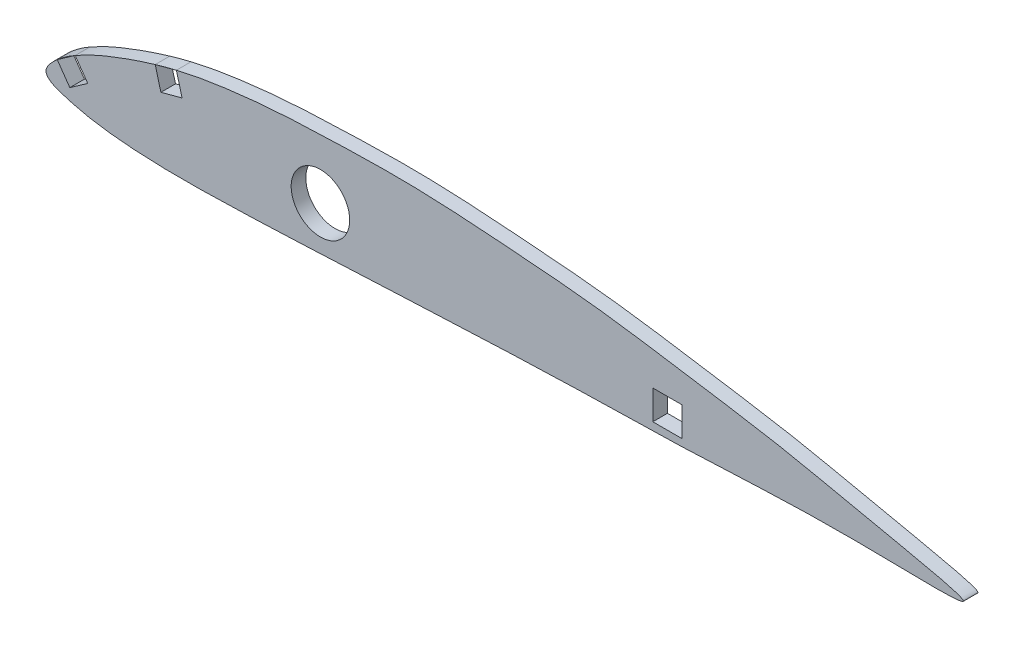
ISO-10303-21;
HEADER;
FILE_DESCRIPTION(('STEP AP214'),'2;1');
FILE_NAME('part.step','',(''),(''),'','','');
FILE_SCHEMA(('AUTOMOTIVE_DESIGN { 1 0 10303 214 1 1 1 1 }'));
ENDSEC;
DATA;
#1=APPLICATION_CONTEXT('core data for automotive mechanical design processes');
#2=APPLICATION_PROTOCOL_DEFINITION('international standard','automotive_design',2000,#1);
#3=PRODUCT_CONTEXT('',#1,'mechanical');
#4=PRODUCT('Part','Part','',(#3));
#5=PRODUCT_RELATED_PRODUCT_CATEGORY('part','',(#4));
#6=PRODUCT_DEFINITION_FORMATION('','',#4);
#7=PRODUCT_DEFINITION_CONTEXT('part definition',#1,'design');
#8=PRODUCT_DEFINITION('design','',#6,#7);
#9=PRODUCT_DEFINITION_SHAPE('','',#8);
#10=(LENGTH_UNIT() NAMED_UNIT(*) SI_UNIT(.MILLI.,.METRE.));
#11=(NAMED_UNIT(*) PLANE_ANGLE_UNIT() SI_UNIT($,.RADIAN.));
#12=(NAMED_UNIT(*) SI_UNIT($,.STERADIAN.) SOLID_ANGLE_UNIT());
#13=UNCERTAINTY_MEASURE_WITH_UNIT(LENGTH_MEASURE(1.E-05),#10,'distance_accuracy_value','');
#14=(GEOMETRIC_REPRESENTATION_CONTEXT(3) GLOBAL_UNCERTAINTY_ASSIGNED_CONTEXT((#13)) GLOBAL_UNIT_ASSIGNED_CONTEXT((#10,
#11,#12)) REPRESENTATION_CONTEXT('',''));
#15=CARTESIAN_POINT('',(0.,0.,0.));
#16=DIRECTION('',(0.,0.,1.));
#17=DIRECTION('',(1.,0.,0.));
#18=AXIS2_PLACEMENT_3D('',#15,#16,#17);
#19=CARTESIAN_POINT('',(0.,0.,0.));
#20=DIRECTION('',(0.,0.,-1.));
#21=DIRECTION('',(-1.,0.,0.));
#22=AXIS2_PLACEMENT_3D('',#19,#20,#21);
#23=PLANE('',#22);
#24=DIRECTION('',(0.,1.,0.));
#25=VECTOR('',#24,1.);
#26=CARTESIAN_POINT('',(131.732,0.,0.));
#27=LINE('',#26,#25);
#28=CARTESIAN_POINT('',(131.732,0.,0.));
#29=VERTEX_POINT('',#28);
#30=CARTESIAN_POINT('',(131.732,6.35,0.));
#31=VERTEX_POINT('',#30);
#32=EDGE_CURVE('E195',#29,#31,#27,.T.);
#33=ORIENTED_EDGE('',*,*,#32,.F.);
#34=DIRECTION('',(-1.,0.,0.));
#35=VECTOR('',#34,1.);
#36=CARTESIAN_POINT('',(0.,0.,0.));
#37=LINE('',#36,#35);
#38=CARTESIAN_POINT('',(138.082,0.,0.));
#39=VERTEX_POINT('',#38);
#40=EDGE_CURVE('E143',#39,#29,#37,.T.);
#41=ORIENTED_EDGE('',*,*,#40,.F.);
#42=DIRECTION('',(0.,-1.,0.));
#43=VECTOR('',#42,1.);
#44=CARTESIAN_POINT('',(138.082,0.,0.));
#45=LINE('',#44,#43);
#46=CARTESIAN_POINT('',(138.082,6.35,0.));
#47=VERTEX_POINT('',#46);
#48=EDGE_CURVE('E131',#47,#39,#45,.T.);
#49=ORIENTED_EDGE('',*,*,#48,.F.);
#50=DIRECTION('',(1.,0.,0.));
#51=VECTOR('',#50,1.);
#52=CARTESIAN_POINT('',(0.,6.35,0.));
#53=LINE('',#52,#51);
#54=EDGE_CURVE('E151',#31,#47,#53,.T.);
#55=ORIENTED_EDGE('',*,*,#54,.F.);
#56=EDGE_LOOP('',(#33,#41,#49,#55));
#57=FACE_BOUND('',#56,.T.);
#58=DIRECTION('',(-0.573576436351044,0.819152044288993,0.));
#59=VECTOR('',#58,1.);
#60=CARTESIAN_POINT('',(3.25221507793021,2.277225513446,0.));
#61=LINE('',#60,#59);
#62=CARTESIAN_POINT('',(5.16941881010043,-0.460825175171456,0.));
#63=VERTEX_POINT('',#62);
#64=CARTESIAN_POINT('',(2.43776103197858,3.44038643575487,0.));
#65=VERTEX_POINT('',#64);
#66=EDGE_CURVE('E157',#63,#65,#61,.T.);
#67=ORIENTED_EDGE('',*,*,#66,.F.);
#68=DIRECTION('',(-0.819152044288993,-0.573576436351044,0.));
#69=VECTOR('',#68,1.);
#70=CARTESIAN_POINT('',(1.91720373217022,-2.73805068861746,0.));
#71=LINE('',#70,#69);
#72=CARTESIAN_POINT('',(9.07063042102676,2.27083260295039,0.));
#73=VERTEX_POINT('',#72);
#74=EDGE_CURVE('E214',#73,#63,#71,.T.);
#75=ORIENTED_EDGE('',*,*,#74,.F.);
#76=DIRECTION('',(0.573576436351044,-0.819152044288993,0.));
#77=VECTOR('',#76,1.);
#78=CARTESIAN_POINT('',(7.15342668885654,5.00888329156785,0.));
#79=LINE('',#78,#77);
#80=CARTESIAN_POINT('',(6.33897264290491,6.17204421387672,0.));
#81=VERTEX_POINT('',#80);
#82=EDGE_CURVE('E224',#81,#73,#79,.T.);
#83=ORIENTED_EDGE('',*,*,#82,.F.);
#84=CARTESIAN_POINT('',(0.,0.,0.));
#85=CARTESIAN_POINT('',(-0.054866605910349,1.06548136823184,0.));
#86=CARTESIAN_POINT('',(2.27173112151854,3.45728737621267,0.));
#87=CARTESIAN_POINT('',(5.57621818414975,5.82398655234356,0.));
#88=CARTESIAN_POINT('',(9.8590794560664,8.13026814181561,0.));
#89=CARTESIAN_POINT('',(18.0609158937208,11.4665419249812,0.));
#90=CARTESIAN_POINT('',(28.0102288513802,14.6409150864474,0.));
#91=CARTESIAN_POINT('',(39.7874006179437,16.5242929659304,0.));
#92=CARTESIAN_POINT('',(49.7692370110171,17.5204467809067,0.));
#93=CARTESIAN_POINT('',(63.056038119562,18.0772974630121,0.));
#94=CARTESIAN_POINT('',(79.6812557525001,18.5488361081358,0.));
#95=CARTESIAN_POINT('',(99.5792865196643,17.1523075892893,0.));
#96=CARTESIAN_POINT('',(119.620979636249,15.590660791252,0.));
#97=CARTESIAN_POINT('',(139.20791019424,12.4529841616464,0.));
#98=CARTESIAN_POINT('',(160.219389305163,9.24084376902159,0.));
#99=CARTESIAN_POINT('',(176.254578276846,5.46848372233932,0.));
#100=CARTESIAN_POINT('',(210.388323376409,-1.29279230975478,0.));
#101=CARTESIAN_POINT('',(166.22275000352,0.262824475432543,0.));
#102=CARTESIAN_POINT('',(147.016186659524,-1.49488148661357,0.));
#103=CARTESIAN_POINT('',(105.554394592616,-2.14848036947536,0.));
#104=CARTESIAN_POINT('',(73.1438515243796,-3.91449443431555,0.));
#105=CARTESIAN_POINT('',(39.7743170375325,-5.3690409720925,0.));
#106=CARTESIAN_POINT('',(23.3749737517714,-5.63794403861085,0.));
#107=CARTESIAN_POINT('',(11.3042610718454,-4.46885896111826,0.));
#108=CARTESIAN_POINT('',(5.1592422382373,-3.06380477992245,0.));
#109=CARTESIAN_POINT('',(0.0752912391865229,-1.46211727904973,0.));
#110=CARTESIAN_POINT('',(0.,0.,0.));
#111=B_SPLINE_CURVE_WITH_KNOTS('',3,(#84,#85,#86,#87,#88,#89,#90,#91,#92,#93,#94,#95,#96,#97,
#98,#99,#100,#101,#102,#103,#104,#105,#106,#107,#108,#109,#110),.UNSPECIFIED.,.T.,.F.,(4,1,1,1,
1,1,1,1,1,1,1,1,1,1,1,1,1,1,1,1,1,1,1,1,4),(0.,0.0105604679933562,0.0182111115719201,
0.0322098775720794,0.0455249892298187,0.0840694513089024,0.10897429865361,0.133649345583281,
0.158232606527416,0.207343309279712,0.25652270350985,0.30582635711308,0.355445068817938,
0.40521420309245,0.4553904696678,0.506006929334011,0.555121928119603,0.653369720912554,
0.702490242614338,0.849938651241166,0.899083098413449,0.948194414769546,0.972905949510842,
0.985508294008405,1.),.UNSPECIFIED.);
#112=CARTESIAN_POINT('',(23.7053663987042,13.1425471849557,0.));
#113=VERTEX_POINT('',#112);
#114=EDGE_CURVE('E170',#81,#113,#111,.T.);
#115=ORIENTED_EDGE('',*,*,#114,.T.);
#116=DIRECTION('',(-0.258819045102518,0.965925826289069,0.));
#117=VECTOR('',#116,1.);
#118=CARTESIAN_POINT('',(25.4030447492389,6.80672532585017,0.));
#119=LINE('',#118,#117);
#120=CARTESIAN_POINT('',(24.9379921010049,8.54232543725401,0.));
#121=VERTEX_POINT('',#120);
#122=EDGE_CURVE('E206',#121,#113,#119,.T.);
#123=ORIENTED_EDGE('',*,*,#122,.F.);
#124=DIRECTION('',(-0.965925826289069,-0.258819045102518,0.));
#125=VECTOR('',#124,1.);
#126=CARTESIAN_POINT('',(-0.465052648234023,1.73560011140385,0.));
#127=LINE('',#126,#125);
#128=CARTESIAN_POINT('',(29.5382138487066,9.77495113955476,0.));
#129=VERTEX_POINT('',#128);
#130=EDGE_CURVE('E218',#129,#121,#127,.T.);
#131=ORIENTED_EDGE('',*,*,#130,.F.);
#132=DIRECTION('',(0.258819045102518,-0.965925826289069,0.));
#133=VECTOR('',#132,1.);
#134=CARTESIAN_POINT('',(30.0032664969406,8.03935102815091,0.));
#135=LINE('',#134,#133);
#136=CARTESIAN_POINT('',(28.3055881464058,14.3751728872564,0.));
#137=VERTEX_POINT('',#136);
#138=EDGE_CURVE('E228',#137,#129,#135,.T.);
#139=ORIENTED_EDGE('',*,*,#138,.F.);
#140=EDGE_CURVE('E163',#137,#65,#111,.T.);
#141=ORIENTED_EDGE('',*,*,#140,.T.);
#142=EDGE_LOOP('',(#67,#75,#83,#115,#123,#131,#139,#141));
#143=FACE_BOUND('',#142,.T.);
#144=CARTESIAN_POINT('',(59.575,5.,0.));
#145=DIRECTION('',(0.,0.,-1.));
#146=DIRECTION('',(-1.,0.,0.));
#147=AXIS2_PLACEMENT_3D('',#144,#145,#146);
#148=CIRCLE('',#147,6.35);
#149=CARTESIAN_POINT('',(53.225,5.,0.));
#150=VERTEX_POINT('',#149);
#151=EDGE_CURVE('E201',#150,#150,#148,.T.);
#152=ORIENTED_EDGE('',*,*,#151,.F.);
#153=EDGE_LOOP('',(#152));
#154=FACE_BOUND('',#153,.T.);
#155=ADVANCED_FACE('F44',(#57,#143,#154),#23,.T.);
#156=CARTESIAN_POINT('',(0.,0.,3.175));
#157=DIRECTION('',(0.,0.,-1.));
#158=DIRECTION('',(-1.,0.,0.));
#159=AXIS2_PLACEMENT_3D('',#156,#157,#158);
#160=PLANE('',#159);
#161=DIRECTION('',(1.,0.,0.));
#162=VECTOR('',#161,1.);
#163=CARTESIAN_POINT('',(131.732,0.,3.175));
#164=LINE('',#163,#162);
#165=CARTESIAN_POINT('',(131.732,0.,3.175));
#166=VERTEX_POINT('',#165);
#167=CARTESIAN_POINT('',(138.082,0.,3.175));
#168=VERTEX_POINT('',#167);
#169=EDGE_CURVE('E13',#166,#168,#164,.T.);
#170=ORIENTED_EDGE('',*,*,#169,.F.);
#171=DIRECTION('',(0.,-1.,0.));
#172=VECTOR('',#171,1.);
#173=CARTESIAN_POINT('',(131.732,6.35,3.175));
#174=LINE('',#173,#172);
#175=CARTESIAN_POINT('',(131.732,6.35,3.175));
#176=VERTEX_POINT('',#175);
#177=EDGE_CURVE('E149',#176,#166,#174,.T.);
#178=ORIENTED_EDGE('',*,*,#177,.F.);
#179=DIRECTION('',(-1.,0.,0.));
#180=VECTOR('',#179,1.);
#181=CARTESIAN_POINT('',(131.732,6.35,3.175));
#182=LINE('',#181,#180);
#183=CARTESIAN_POINT('',(138.082,6.35,3.175));
#184=VERTEX_POINT('',#183);
#185=EDGE_CURVE('E142',#184,#176,#182,.T.);
#186=ORIENTED_EDGE('',*,*,#185,.F.);
#187=DIRECTION('',(0.,1.,0.));
#188=VECTOR('',#187,1.);
#189=CARTESIAN_POINT('',(138.082,6.35,3.175));
#190=LINE('',#189,#188);
#191=EDGE_CURVE('E128',#168,#184,#190,.T.);
#192=ORIENTED_EDGE('',*,*,#191,.F.);
#193=EDGE_LOOP('',(#170,#178,#186,#192));
#194=FACE_BOUND('',#193,.T.);
#195=CARTESIAN_POINT('',(59.575,5.,3.175));
#196=DIRECTION('',(0.,0.,1.));
#197=DIRECTION('',(1.,0.,0.));
#198=AXIS2_PLACEMENT_3D('',#195,#196,#197);
#199=CIRCLE('',#198,6.35);
#200=CARTESIAN_POINT('',(65.925,5.,3.175));
#201=VERTEX_POINT('',#200);
#202=EDGE_CURVE('E203',#201,#201,#199,.T.);
#203=ORIENTED_EDGE('',*,*,#202,.F.);
#204=EDGE_LOOP('',(#203));
#205=FACE_BOUND('',#204,.T.);
#206=DIRECTION('',(0.819152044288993,0.573576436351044,0.));
#207=VECTOR('',#206,1.);
#208=CARTESIAN_POINT('',(5.16941881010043,-0.460825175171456,3.175));
#209=LINE('',#208,#207);
#210=CARTESIAN_POINT('',(5.16941881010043,-0.460825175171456,3.175));
#211=VERTEX_POINT('',#210);
#212=CARTESIAN_POINT('',(9.07063042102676,2.27083260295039,3.175));
#213=VERTEX_POINT('',#212);
#214=EDGE_CURVE('E211',#211,#213,#209,.T.);
#215=ORIENTED_EDGE('',*,*,#214,.F.);
#216=DIRECTION('',(0.573576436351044,-0.819152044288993,0.));
#217=VECTOR('',#216,1.);
#218=CARTESIAN_POINT('',(2.43776103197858,3.44038643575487,3.175));
#219=LINE('',#218,#217);
#220=CARTESIAN_POINT('',(2.43776103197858,3.44038643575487,3.175));
#221=VERTEX_POINT('',#220);
#222=EDGE_CURVE('E156',#221,#211,#219,.T.);
#223=ORIENTED_EDGE('',*,*,#222,.F.);
#224=CARTESIAN_POINT('',(0.,0.,3.175));
#225=CARTESIAN_POINT('',(-0.054866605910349,1.06548136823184,3.175));
#226=CARTESIAN_POINT('',(2.27173112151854,3.45728737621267,3.175));
#227=CARTESIAN_POINT('',(5.57621818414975,5.82398655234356,3.175));
#228=CARTESIAN_POINT('',(9.8590794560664,8.13026814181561,3.175));
#229=CARTESIAN_POINT('',(18.0609158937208,11.4665419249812,3.175));
#230=CARTESIAN_POINT('',(28.0102288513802,14.6409150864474,3.175));
#231=CARTESIAN_POINT('',(39.7874006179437,16.5242929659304,3.175));
#232=CARTESIAN_POINT('',(49.7692370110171,17.5204467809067,3.175));
#233=CARTESIAN_POINT('',(63.056038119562,18.0772974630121,3.175));
#234=CARTESIAN_POINT('',(79.6812557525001,18.5488361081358,3.175));
#235=CARTESIAN_POINT('',(99.5792865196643,17.1523075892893,3.175));
#236=CARTESIAN_POINT('',(119.620979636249,15.590660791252,3.175));
#237=CARTESIAN_POINT('',(139.20791019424,12.4529841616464,3.175));
#238=CARTESIAN_POINT('',(160.219389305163,9.24084376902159,3.175));
#239=CARTESIAN_POINT('',(176.254578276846,5.46848372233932,3.175));
#240=CARTESIAN_POINT('',(210.388323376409,-1.29279230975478,3.175));
#241=CARTESIAN_POINT('',(166.22275000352,0.262824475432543,3.175));
#242=CARTESIAN_POINT('',(147.016186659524,-1.49488148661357,3.175));
#243=CARTESIAN_POINT('',(105.554394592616,-2.14848036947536,3.175));
#244=CARTESIAN_POINT('',(73.1438515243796,-3.91449443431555,3.175));
#245=CARTESIAN_POINT('',(39.7743170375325,-5.3690409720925,3.175));
#246=CARTESIAN_POINT('',(23.3749737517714,-5.63794403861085,3.175));
#247=CARTESIAN_POINT('',(11.3042610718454,-4.46885896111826,3.175));
#248=CARTESIAN_POINT('',(5.1592422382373,-3.06380477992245,3.175));
#249=CARTESIAN_POINT('',(0.0752912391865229,-1.46211727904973,3.175));
#250=CARTESIAN_POINT('',(0.,0.,3.175));
#251=B_SPLINE_CURVE_WITH_KNOTS('',3,(#224,#225,#226,#227,#228,#229,#230,#231,#232,#233,#234,
#235,#236,#237,#238,#239,#240,#241,#242,#243,#244,#245,#246,#247,#248,#249,#250),.UNSPECIFIED.,
.T.,.F.,(4,1,1,1,1,1,1,1,1,1,1,1,1,1,1,1,1,1,1,1,1,1,1,1,4),(0.,0.0105604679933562,
0.0182111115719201,0.0322098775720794,0.0455249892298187,0.0840694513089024,0.10897429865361,
0.133649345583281,0.158232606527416,0.207343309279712,0.25652270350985,0.30582635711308,
0.355445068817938,0.40521420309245,0.4553904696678,0.506006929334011,0.555121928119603,
0.653369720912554,0.702490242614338,0.849938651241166,0.899083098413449,0.948194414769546,
0.972905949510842,0.985508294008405,1.),.UNSPECIFIED.);
#252=CARTESIAN_POINT('',(28.3055881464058,14.3751728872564,3.175));
#253=VERTEX_POINT('',#252);
#254=EDGE_CURVE('E162',#253,#221,#251,.T.);
#255=ORIENTED_EDGE('',*,*,#254,.F.);
#256=DIRECTION('',(-0.258819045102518,0.965925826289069,0.));
#257=VECTOR('',#256,1.);
#258=CARTESIAN_POINT('',(28.3055881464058,14.3751728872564,3.175));
#259=LINE('',#258,#257);
#260=CARTESIAN_POINT('',(29.5382138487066,9.77495113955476,3.175));
#261=VERTEX_POINT('',#260);
#262=EDGE_CURVE('E221',#261,#253,#259,.T.);
#263=ORIENTED_EDGE('',*,*,#262,.F.);
#264=DIRECTION('',(0.965925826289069,0.258819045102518,0.));
#265=VECTOR('',#264,1.);
#266=CARTESIAN_POINT('',(24.9379921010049,8.54232543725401,3.175));
#267=LINE('',#266,#265);
#268=CARTESIAN_POINT('',(24.9379921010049,8.54232543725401,3.175));
#269=VERTEX_POINT('',#268);
#270=EDGE_CURVE('E223',#269,#261,#267,.T.);
#271=ORIENTED_EDGE('',*,*,#270,.F.);
#272=DIRECTION('',(0.258819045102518,-0.965925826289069,0.));
#273=VECTOR('',#272,1.);
#274=CARTESIAN_POINT('',(23.7053663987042,13.1425471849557,3.175));
#275=LINE('',#274,#273);
#276=CARTESIAN_POINT('',(23.7053663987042,13.1425471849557,3.175));
#277=VERTEX_POINT('',#276);
#278=EDGE_CURVE('E231',#277,#269,#275,.T.);
#279=ORIENTED_EDGE('',*,*,#278,.F.);
#280=CARTESIAN_POINT('',(6.3389726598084,6.17204422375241,3.175));
#281=VERTEX_POINT('',#280);
#282=EDGE_CURVE('E161',#281,#277,#251,.T.);
#283=ORIENTED_EDGE('',*,*,#282,.F.);
#284=DIRECTION('',(-0.573576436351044,0.819152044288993,0.));
#285=VECTOR('',#284,1.);
#286=CARTESIAN_POINT('',(6.33897264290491,6.17204421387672,3.175));
#287=LINE('',#286,#285);
#288=EDGE_CURVE('E217',#213,#281,#287,.T.);
#289=ORIENTED_EDGE('',*,*,#288,.F.);
#290=EDGE_LOOP('',(#215,#223,#255,#263,#271,#279,#283,#289));
#291=FACE_BOUND('',#290,.T.);
#292=ADVANCED_FACE('F140',(#194,#205,#291),#160,.F.);
#293=DIRECTION('',(0.,0.,1.));
#294=VECTOR('',#293,1.);
#295=SURFACE_OF_LINEAR_EXTRUSION('',#111,#294);
#296=DIRECTION('',(0.,0.,1.));
#297=VECTOR('',#296,1.);
#298=CARTESIAN_POINT('',(2.43776103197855,3.44038643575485,0.));
#299=LINE('',#298,#297);
#300=EDGE_CURVE('E153',#65,#221,#299,.T.);
#301=ORIENTED_EDGE('',*,*,#300,.F.);
#302=ORIENTED_EDGE('',*,*,#140,.F.);
#303=DIRECTION('',(0.,0.,1.));
#304=VECTOR('',#303,1.);
#305=CARTESIAN_POINT('',(28.3055881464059,14.3751728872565,0.));
#306=LINE('',#305,#304);
#307=EDGE_CURVE('E169',#137,#253,#306,.T.);
#308=ORIENTED_EDGE('',*,*,#307,.T.);
#309=ORIENTED_EDGE('',*,*,#254,.T.);
#310=EDGE_LOOP('',(#301,#302,#308,#309));
#311=FACE_BOUND('',#310,.T.);
#312=ADVANCED_FACE('F179',(#311),#295,.F.);
#313=ORIENTED_EDGE('',*,*,#114,.F.);
#314=DIRECTION('',(0.,0.,1.));
#315=VECTOR('',#314,1.);
#316=CARTESIAN_POINT('',(6.33897264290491,6.17204421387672,0.));
#317=LINE('',#316,#315);
#318=EDGE_CURVE('E158',#81,#281,#317,.T.);
#319=ORIENTED_EDGE('',*,*,#318,.T.);
#320=ORIENTED_EDGE('',*,*,#282,.T.);
#321=DIRECTION('',(0.,0.,1.));
#322=VECTOR('',#321,1.);
#323=CARTESIAN_POINT('',(23.7053663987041,13.1425471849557,0.));
#324=LINE('',#323,#322);
#325=EDGE_CURVE('E47',#113,#277,#324,.T.);
#326=ORIENTED_EDGE('',*,*,#325,.F.);
#327=EDGE_LOOP('',(#313,#319,#320,#326));
#328=FACE_BOUND('',#327,.T.);
#329=ADVANCED_FACE('F175',(#328),#295,.F.);
#330=CARTESIAN_POINT('',(59.575,5.,-6.825));
#331=DIRECTION('',(0.,0.,1.));
#332=DIRECTION('',(1.,0.,0.));
#333=AXIS2_PLACEMENT_3D('',#330,#331,#332);
#334=CYLINDRICAL_SURFACE('',#333,6.35);
#335=ORIENTED_EDGE('',*,*,#151,.T.);
#336=EDGE_LOOP('',(#335));
#337=FACE_BOUND('',#336,.T.);
#338=ORIENTED_EDGE('',*,*,#202,.T.);
#339=EDGE_LOOP('',(#338));
#340=FACE_BOUND('',#339,.T.);
#341=ADVANCED_FACE('F178',(#337,#340),#334,.F.);
#342=CARTESIAN_POINT('',(23.7053663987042,13.1425471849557,-6.825));
#343=DIRECTION('',(-0.965925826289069,-0.258819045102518,0.));
#344=DIRECTION('',(0.258819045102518,-0.965925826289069,0.));
#345=AXIS2_PLACEMENT_3D('',#342,#343,#344);
#346=PLANE('',#345);
#347=ORIENTED_EDGE('',*,*,#122,.T.);
#348=ORIENTED_EDGE('',*,*,#325,.T.);
#349=ORIENTED_EDGE('',*,*,#278,.T.);
#350=DIRECTION('',(0.,0.,1.));
#351=VECTOR('',#350,1.);
#352=CARTESIAN_POINT('',(24.9379921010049,8.54232543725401,-6.825));
#353=LINE('',#352,#351);
#354=EDGE_CURVE('E220',#121,#269,#353,.T.);
#355=ORIENTED_EDGE('',*,*,#354,.F.);
#356=EDGE_LOOP('',(#347,#348,#349,#355));
#357=FACE_BOUND('',#356,.T.);
#358=ADVANCED_FACE('F324',(#357),#346,.F.);
#359=CARTESIAN_POINT('',(28.3055881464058,14.3751728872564,-6.825));
#360=DIRECTION('',(0.965925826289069,0.258819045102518,0.));
#361=DIRECTION('',(-0.258819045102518,0.965925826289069,0.));
#362=AXIS2_PLACEMENT_3D('',#359,#360,#361);
#363=PLANE('',#362);
#364=ORIENTED_EDGE('',*,*,#138,.T.);
#365=DIRECTION('',(0.,0.,1.));
#366=VECTOR('',#365,1.);
#367=CARTESIAN_POINT('',(29.5382138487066,9.77495113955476,-6.825));
#368=LINE('',#367,#366);
#369=EDGE_CURVE('E230',#129,#261,#368,.T.);
#370=ORIENTED_EDGE('',*,*,#369,.T.);
#371=ORIENTED_EDGE('',*,*,#262,.T.);
#372=ORIENTED_EDGE('',*,*,#307,.F.);
#373=EDGE_LOOP('',(#364,#370,#371,#372));
#374=FACE_BOUND('',#373,.T.);
#375=ADVANCED_FACE('F314',(#374),#363,.F.);
#376=CARTESIAN_POINT('',(24.9379921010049,8.54232543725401,-6.825));
#377=DIRECTION('',(0.258819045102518,-0.965925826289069,0.));
#378=DIRECTION('',(0.965925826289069,0.258819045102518,0.));
#379=AXIS2_PLACEMENT_3D('',#376,#377,#378);
#380=PLANE('',#379);
#381=ORIENTED_EDGE('',*,*,#130,.T.);
#382=ORIENTED_EDGE('',*,*,#354,.T.);
#383=ORIENTED_EDGE('',*,*,#270,.T.);
#384=ORIENTED_EDGE('',*,*,#369,.F.);
#385=EDGE_LOOP('',(#381,#382,#383,#384));
#386=FACE_BOUND('',#385,.T.);
#387=ADVANCED_FACE('F304',(#386),#380,.F.);
#388=CARTESIAN_POINT('',(2.43776103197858,3.44038643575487,-6.825));
#389=DIRECTION('',(-0.819152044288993,-0.573576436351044,0.));
#390=DIRECTION('',(0.573576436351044,-0.819152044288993,0.));
#391=AXIS2_PLACEMENT_3D('',#388,#389,#390);
#392=PLANE('',#391);
#393=ORIENTED_EDGE('',*,*,#66,.T.);
#394=ORIENTED_EDGE('',*,*,#300,.T.);
#395=ORIENTED_EDGE('',*,*,#222,.T.);
#396=DIRECTION('',(0.,0.,1.));
#397=VECTOR('',#396,1.);
#398=CARTESIAN_POINT('',(5.16941881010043,-0.460825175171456,-6.825));
#399=LINE('',#398,#397);
#400=EDGE_CURVE('E216',#63,#211,#399,.T.);
#401=ORIENTED_EDGE('',*,*,#400,.F.);
#402=EDGE_LOOP('',(#393,#394,#395,#401));
#403=FACE_BOUND('',#402,.T.);
#404=ADVANCED_FACE('F295',(#403),#392,.F.);
#405=CARTESIAN_POINT('',(6.33897264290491,6.17204421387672,-6.825));
#406=DIRECTION('',(0.819152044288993,0.573576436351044,0.));
#407=DIRECTION('',(-0.573576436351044,0.819152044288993,0.));
#408=AXIS2_PLACEMENT_3D('',#405,#406,#407);
#409=PLANE('',#408);
#410=ORIENTED_EDGE('',*,*,#82,.T.);
#411=DIRECTION('',(0.,0.,1.));
#412=VECTOR('',#411,1.);
#413=CARTESIAN_POINT('',(9.07063042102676,2.27083260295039,-6.825));
#414=LINE('',#413,#412);
#415=EDGE_CURVE('E226',#73,#213,#414,.T.);
#416=ORIENTED_EDGE('',*,*,#415,.T.);
#417=ORIENTED_EDGE('',*,*,#288,.T.);
#418=ORIENTED_EDGE('',*,*,#318,.F.);
#419=EDGE_LOOP('',(#410,#416,#417,#418));
#420=FACE_BOUND('',#419,.T.);
#421=ADVANCED_FACE('F260',(#420),#409,.F.);
#422=CARTESIAN_POINT('',(5.16941881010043,-0.460825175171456,-6.825));
#423=DIRECTION('',(0.573576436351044,-0.819152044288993,0.));
#424=DIRECTION('',(0.819152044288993,0.573576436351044,0.));
#425=AXIS2_PLACEMENT_3D('',#422,#423,#424);
#426=PLANE('',#425);
#427=ORIENTED_EDGE('',*,*,#74,.T.);
#428=ORIENTED_EDGE('',*,*,#400,.T.);
#429=ORIENTED_EDGE('',*,*,#214,.T.);
#430=ORIENTED_EDGE('',*,*,#415,.F.);
#431=EDGE_LOOP('',(#427,#428,#429,#430));
#432=FACE_BOUND('',#431,.T.);
#433=ADVANCED_FACE('F255',(#432),#426,.F.);
#434=CARTESIAN_POINT('',(131.732,6.35,-6.825));
#435=DIRECTION('',(-1.,0.,0.));
#436=DIRECTION('',(0.,0.,1.));
#437=AXIS2_PLACEMENT_3D('',#434,#435,#436);
#438=PLANE('',#437);
#439=ORIENTED_EDGE('',*,*,#32,.T.);
#440=DIRECTION('',(0.,0.,1.));
#441=VECTOR('',#440,1.);
#442=CARTESIAN_POINT('',(131.732,6.35,-6.825));
#443=LINE('',#442,#441);
#444=EDGE_CURVE('E152',#31,#176,#443,.T.);
#445=ORIENTED_EDGE('',*,*,#444,.T.);
#446=ORIENTED_EDGE('',*,*,#177,.T.);
#447=DIRECTION('',(0.,0.,1.));
#448=VECTOR('',#447,1.);
#449=CARTESIAN_POINT('',(131.732,0.,-6.825));
#450=LINE('',#449,#448);
#451=EDGE_CURVE('E53',#29,#166,#450,.T.);
#452=ORIENTED_EDGE('',*,*,#451,.F.);
#453=EDGE_LOOP('',(#439,#445,#446,#452));
#454=FACE_BOUND('',#453,.T.);
#455=ADVANCED_FACE('F249',(#454),#438,.F.);
#456=CARTESIAN_POINT('',(131.732,6.35,-6.825));
#457=DIRECTION('',(0.,1.,0.));
#458=DIRECTION('',(0.,0.,1.));
#459=AXIS2_PLACEMENT_3D('',#456,#457,#458);
#460=PLANE('',#459);
#461=ORIENTED_EDGE('',*,*,#54,.T.);
#462=DIRECTION('',(0.,0.,1.));
#463=VECTOR('',#462,1.);
#464=CARTESIAN_POINT('',(138.082,6.35,-6.825));
#465=LINE('',#464,#463);
#466=EDGE_CURVE('E123',#47,#184,#465,.T.);
#467=ORIENTED_EDGE('',*,*,#466,.T.);
#468=ORIENTED_EDGE('',*,*,#185,.T.);
#469=ORIENTED_EDGE('',*,*,#444,.F.);
#470=EDGE_LOOP('',(#461,#467,#468,#469));
#471=FACE_BOUND('',#470,.T.);
#472=ADVANCED_FACE('F181',(#471),#460,.F.);
#473=CARTESIAN_POINT('',(138.082,6.35,-6.825));
#474=DIRECTION('',(1.,0.,0.));
#475=DIRECTION('',(0.,0.,-1.));
#476=AXIS2_PLACEMENT_3D('',#473,#474,#475);
#477=PLANE('',#476);
#478=ORIENTED_EDGE('',*,*,#48,.T.);
#479=DIRECTION('',(0.,0.,1.));
#480=VECTOR('',#479,1.);
#481=CARTESIAN_POINT('',(138.082,0.,-6.825));
#482=LINE('',#481,#480);
#483=EDGE_CURVE('E61',#39,#168,#482,.T.);
#484=ORIENTED_EDGE('',*,*,#483,.T.);
#485=ORIENTED_EDGE('',*,*,#191,.T.);
#486=ORIENTED_EDGE('',*,*,#466,.F.);
#487=EDGE_LOOP('',(#478,#484,#485,#486));
#488=FACE_BOUND('',#487,.T.);
#489=ADVANCED_FACE('F126',(#488),#477,.F.);
#490=CARTESIAN_POINT('',(131.732,0.,-6.825));
#491=DIRECTION('',(0.,-1.,0.));
#492=DIRECTION('',(0.,0.,-1.));
#493=AXIS2_PLACEMENT_3D('',#490,#491,#492);
#494=PLANE('',#493);
#495=ORIENTED_EDGE('',*,*,#40,.T.);
#496=ORIENTED_EDGE('',*,*,#451,.T.);
#497=ORIENTED_EDGE('',*,*,#169,.T.);
#498=ORIENTED_EDGE('',*,*,#483,.F.);
#499=EDGE_LOOP('',(#495,#496,#497,#498));
#500=FACE_BOUND('',#499,.T.);
#501=ADVANCED_FACE('F136',(#500),#494,.F.);
#502=CLOSED_SHELL('',(#155,#292,#312,#329,#341,#358,#375,#387,#404,#421,#433,#455,#472,#489,#501));
#503=MANIFOLD_SOLID_BREP('B2',#502);
#504=CARTESIAN_POINT('',(0.,0.,0.));
#505=CARTESIAN_POINT('',(-0.054866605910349,1.06548136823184,0.));
#506=CARTESIAN_POINT('',(2.27173112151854,3.45728737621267,0.));
#507=CARTESIAN_POINT('',(5.57621818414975,5.82398655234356,0.));
#508=CARTESIAN_POINT('',(9.8590794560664,8.13026814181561,0.));
#509=CARTESIAN_POINT('',(18.0609158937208,11.4665419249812,0.));
#510=CARTESIAN_POINT('',(28.0102288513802,14.6409150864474,0.));
#511=CARTESIAN_POINT('',(39.7874006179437,16.5242929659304,0.));
#512=CARTESIAN_POINT('',(49.7692370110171,17.5204467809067,0.));
#513=CARTESIAN_POINT('',(63.056038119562,18.0772974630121,0.));
#514=CARTESIAN_POINT('',(79.6812557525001,18.5488361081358,0.));
#515=CARTESIAN_POINT('',(99.5792865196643,17.1523075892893,0.));
#516=CARTESIAN_POINT('',(119.620979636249,15.590660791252,0.));
#517=CARTESIAN_POINT('',(139.20791019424,12.4529841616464,0.));
#518=CARTESIAN_POINT('',(160.219389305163,9.24084376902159,0.));
#519=CARTESIAN_POINT('',(176.254578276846,5.46848372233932,0.));
#520=CARTESIAN_POINT('',(210.388323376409,-1.29279230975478,0.));
#521=CARTESIAN_POINT('',(166.22275000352,0.262824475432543,0.));
#522=CARTESIAN_POINT('',(147.016186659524,-1.49488148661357,0.));
#523=CARTESIAN_POINT('',(105.554394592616,-2.14848036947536,0.));
#524=CARTESIAN_POINT('',(73.1438515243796,-3.91449443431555,0.));
#525=CARTESIAN_POINT('',(39.7743170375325,-5.3690409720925,0.));
#526=CARTESIAN_POINT('',(23.3749737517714,-5.63794403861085,0.));
#527=CARTESIAN_POINT('',(11.3042610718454,-4.46885896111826,0.));
#528=CARTESIAN_POINT('',(5.1592422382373,-3.06380477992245,0.));
#529=CARTESIAN_POINT('',(0.0752912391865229,-1.46211727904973,0.));
#530=CARTESIAN_POINT('',(0.,0.,0.));
#531=B_SPLINE_CURVE_WITH_KNOTS('',3,(#504,#505,#506,#507,#508,#509,#510,#511,#512,#513,#514,
#515,#516,#517,#518,#519,#520,#521,#522,#523,#524,#525,#526,#527,#528,#529,#530),.UNSPECIFIED.,
.T.,.F.,(4,1,1,1,1,1,1,1,1,1,1,1,1,1,1,1,1,1,1,1,1,1,1,1,4),(0.,0.0105604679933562,
0.0182111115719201,0.0322098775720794,0.0455249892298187,0.0840694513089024,0.10897429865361,
0.133649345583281,0.158232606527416,0.207343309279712,0.25652270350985,0.30582635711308,
0.355445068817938,0.40521420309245,0.4553904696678,0.506006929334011,0.555121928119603,
0.653369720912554,0.702490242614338,0.849938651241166,0.899083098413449,0.948194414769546,
0.972905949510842,0.985508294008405,1.),.UNSPECIFIED.);
#532=DIRECTION('',(0.,0.,1.));
#533=VECTOR('',#532,1.);
#534=SURFACE_OF_LINEAR_EXTRUSION('',#531,#533);
#535=CARTESIAN_POINT('',(23.7053663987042,13.1425471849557,0.));
#536=VERTEX_POINT('',#535);
#537=CARTESIAN_POINT('',(28.3055881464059,14.3751728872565,0.));
#538=VERTEX_POINT('',#537);
#539=EDGE_CURVE('E447',#536,#538,#531,.T.);
#540=ORIENTED_EDGE('',*,*,#539,.F.);
#541=DIRECTION('',(0.,0.,1.));
#542=VECTOR('',#541,1.);
#543=CARTESIAN_POINT('',(23.7053663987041,13.1425471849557,0.));
#544=LINE('',#543,#542);
#545=CARTESIAN_POINT('',(23.7053663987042,13.1425471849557,3.175));
#546=VERTEX_POINT('',#545);
#547=EDGE_CURVE('E434',#536,#546,#544,.T.);
#548=ORIENTED_EDGE('',*,*,#547,.T.);
#549=CARTESIAN_POINT('',(0.,0.,3.175));
#550=CARTESIAN_POINT('',(-0.054866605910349,1.06548136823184,3.175));
#551=CARTESIAN_POINT('',(2.27173112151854,3.45728737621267,3.175));
#552=CARTESIAN_POINT('',(5.57621818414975,5.82398655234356,3.175));
#553=CARTESIAN_POINT('',(9.8590794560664,8.13026814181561,3.175));
#554=CARTESIAN_POINT('',(18.0609158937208,11.4665419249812,3.175));
#555=CARTESIAN_POINT('',(28.0102288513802,14.6409150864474,3.175));
#556=CARTESIAN_POINT('',(39.7874006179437,16.5242929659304,3.175));
#557=CARTESIAN_POINT('',(49.7692370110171,17.5204467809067,3.175));
#558=CARTESIAN_POINT('',(63.056038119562,18.0772974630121,3.175));
#559=CARTESIAN_POINT('',(79.6812557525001,18.5488361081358,3.175));
#560=CARTESIAN_POINT('',(99.5792865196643,17.1523075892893,3.175));
#561=CARTESIAN_POINT('',(119.620979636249,15.590660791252,3.175));
#562=CARTESIAN_POINT('',(139.20791019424,12.4529841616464,3.175));
#563=CARTESIAN_POINT('',(160.219389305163,9.24084376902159,3.175));
#564=CARTESIAN_POINT('',(176.254578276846,5.46848372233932,3.175));
#565=CARTESIAN_POINT('',(210.388323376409,-1.29279230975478,3.175));
#566=CARTESIAN_POINT('',(166.22275000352,0.262824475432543,3.175));
#567=CARTESIAN_POINT('',(147.016186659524,-1.49488148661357,3.175));
#568=CARTESIAN_POINT('',(105.554394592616,-2.14848036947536,3.175));
#569=CARTESIAN_POINT('',(73.1438515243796,-3.91449443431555,3.175));
#570=CARTESIAN_POINT('',(39.7743170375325,-5.3690409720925,3.175));
#571=CARTESIAN_POINT('',(23.3749737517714,-5.63794403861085,3.175));
#572=CARTESIAN_POINT('',(11.3042610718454,-4.46885896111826,3.175));
#573=CARTESIAN_POINT('',(5.1592422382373,-3.06380477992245,3.175));
#574=CARTESIAN_POINT('',(0.0752912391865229,-1.46211727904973,3.175));
#575=CARTESIAN_POINT('',(0.,0.,3.175));
#576=B_SPLINE_CURVE_WITH_KNOTS('',3,(#549,#550,#551,#552,#553,#554,#555,#556,#557,#558,#559,
#560,#561,#562,#563,#564,#565,#566,#567,#568,#569,#570,#571,#572,#573,#574,#575),.UNSPECIFIED.,
.T.,.F.,(4,1,1,1,1,1,1,1,1,1,1,1,1,1,1,1,1,1,1,1,1,1,1,1,4),(0.,0.0105604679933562,
0.0182111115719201,0.0322098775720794,0.0455249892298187,0.0840694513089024,0.10897429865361,
0.133649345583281,0.158232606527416,0.207343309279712,0.25652270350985,0.30582635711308,
0.355445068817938,0.40521420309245,0.4553904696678,0.506006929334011,0.555121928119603,
0.653369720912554,0.702490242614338,0.849938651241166,0.899083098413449,0.948194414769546,
0.972905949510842,0.985508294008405,1.),.UNSPECIFIED.);
#577=CARTESIAN_POINT('',(28.3055881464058,14.3751728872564,3.175));
#578=VERTEX_POINT('',#577);
#579=EDGE_CURVE('E419',#546,#578,#576,.T.);
#580=ORIENTED_EDGE('',*,*,#579,.T.);
#581=DIRECTION('',(0.,0.,1.));
#582=VECTOR('',#581,1.);
#583=CARTESIAN_POINT('',(28.3055881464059,14.3751728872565,0.));
#584=LINE('',#583,#582);
#585=EDGE_CURVE('E427',#538,#578,#584,.T.);
#586=ORIENTED_EDGE('',*,*,#585,.F.);
#587=EDGE_LOOP('',(#540,#548,#580,#586));
#588=FACE_BOUND('',#587,.T.);
#589=ADVANCED_FACE('F415',(#588),#534,.F.);
#590=CARTESIAN_POINT('',(0.,0.,3.175));
#591=DIRECTION('',(0.,0.,-1.));
#592=DIRECTION('',(-1.,0.,0.));
#593=AXIS2_PLACEMENT_3D('',#590,#591,#592);
#594=PLANE('',#593);
#595=ORIENTED_EDGE('',*,*,#579,.F.);
#596=DIRECTION('',(-0.965925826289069,-0.258819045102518,0.));
#597=VECTOR('',#596,1.);
#598=CARTESIAN_POINT('',(23.7053663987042,13.1425471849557,3.175));
#599=LINE('',#598,#597);
#600=EDGE_CURVE('E42',#578,#546,#599,.T.);
#601=ORIENTED_EDGE('',*,*,#600,.F.);
#602=EDGE_LOOP('',(#595,#601));
#603=FACE_BOUND('',#602,.T.);
#604=ADVANCED_FACE('F462',(#603),#594,.F.);
#605=CARTESIAN_POINT('',(0.,0.,0.));
#606=DIRECTION('',(0.,0.,-1.));
#607=DIRECTION('',(-1.,0.,0.));
#608=AXIS2_PLACEMENT_3D('',#605,#606,#607);
#609=PLANE('',#608);
#610=DIRECTION('',(0.965925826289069,0.258819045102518,0.));
#611=VECTOR('',#610,1.);
#612=CARTESIAN_POINT('',(-1.69767835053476,6.33582185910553,0.));
#613=LINE('',#612,#611);
#614=EDGE_CURVE('E441',#536,#538,#613,.T.);
#615=ORIENTED_EDGE('',*,*,#614,.F.);
#616=ORIENTED_EDGE('',*,*,#539,.T.);
#617=EDGE_LOOP('',(#615,#616));
#618=FACE_BOUND('',#617,.T.);
#619=ADVANCED_FACE('F417',(#618),#609,.T.);
#620=CARTESIAN_POINT('',(23.7053663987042,13.1425471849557,-6.825));
#621=DIRECTION('',(-0.258819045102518,0.965925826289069,0.));
#622=DIRECTION('',(-0.965925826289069,-0.258819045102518,0.));
#623=AXIS2_PLACEMENT_3D('',#620,#621,#622);
#624=PLANE('',#623);
#625=ORIENTED_EDGE('',*,*,#614,.T.);
#626=ORIENTED_EDGE('',*,*,#585,.T.);
#627=ORIENTED_EDGE('',*,*,#600,.T.);
#628=ORIENTED_EDGE('',*,*,#547,.F.);
#629=EDGE_LOOP('',(#625,#626,#627,#628));
#630=FACE_BOUND('',#629,.T.);
#631=ADVANCED_FACE('F443',(#630),#624,.F.);
#632=CLOSED_SHELL('',(#589,#604,#619,#631));
#633=MANIFOLD_SOLID_BREP('B7',#632);
#634=CARTESIAN_POINT('',(0.,0.,0.));
#635=CARTESIAN_POINT('',(-0.054866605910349,1.06548136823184,0.));
#636=CARTESIAN_POINT('',(2.27173112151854,3.45728737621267,0.));
#637=CARTESIAN_POINT('',(5.57621818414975,5.82398655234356,0.));
#638=CARTESIAN_POINT('',(9.8590794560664,8.13026814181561,0.));
#639=CARTESIAN_POINT('',(18.0609158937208,11.4665419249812,0.));
#640=CARTESIAN_POINT('',(28.0102288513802,14.6409150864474,0.));
#641=CARTESIAN_POINT('',(39.7874006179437,16.5242929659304,0.));
#642=CARTESIAN_POINT('',(49.7692370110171,17.5204467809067,0.));
#643=CARTESIAN_POINT('',(63.056038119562,18.0772974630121,0.));
#644=CARTESIAN_POINT('',(79.6812557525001,18.5488361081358,0.));
#645=CARTESIAN_POINT('',(99.5792865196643,17.1523075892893,0.));
#646=CARTESIAN_POINT('',(119.620979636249,15.590660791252,0.));
#647=CARTESIAN_POINT('',(139.20791019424,12.4529841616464,0.));
#648=CARTESIAN_POINT('',(160.219389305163,9.24084376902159,0.));
#649=CARTESIAN_POINT('',(176.254578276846,5.46848372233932,0.));
#650=CARTESIAN_POINT('',(210.388323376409,-1.29279230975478,0.));
#651=CARTESIAN_POINT('',(166.22275000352,0.262824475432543,0.));
#652=CARTESIAN_POINT('',(147.016186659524,-1.49488148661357,0.));
#653=CARTESIAN_POINT('',(105.554394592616,-2.14848036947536,0.));
#654=CARTESIAN_POINT('',(73.1438515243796,-3.91449443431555,0.));
#655=CARTESIAN_POINT('',(39.7743170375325,-5.3690409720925,0.));
#656=CARTESIAN_POINT('',(23.3749737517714,-5.63794403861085,0.));
#657=CARTESIAN_POINT('',(11.3042610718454,-4.46885896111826,0.));
#658=CARTESIAN_POINT('',(5.1592422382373,-3.06380477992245,0.));
#659=CARTESIAN_POINT('',(0.0752912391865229,-1.46211727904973,0.));
#660=CARTESIAN_POINT('',(0.,0.,0.));
#661=B_SPLINE_CURVE_WITH_KNOTS('',3,(#634,#635,#636,#637,#638,#639,#640,#641,#642,#643,#644,
#645,#646,#647,#648,#649,#650,#651,#652,#653,#654,#655,#656,#657,#658,#659,#660),.UNSPECIFIED.,
.T.,.F.,(4,1,1,1,1,1,1,1,1,1,1,1,1,1,1,1,1,1,1,1,1,1,1,1,4),(0.,0.0105604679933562,
0.0182111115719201,0.0322098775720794,0.0455249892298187,0.0840694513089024,0.10897429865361,
0.133649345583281,0.158232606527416,0.207343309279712,0.25652270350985,0.30582635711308,
0.355445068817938,0.40521420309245,0.4553904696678,0.506006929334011,0.555121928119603,
0.653369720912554,0.702490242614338,0.849938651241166,0.899083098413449,0.948194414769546,
0.972905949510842,0.985508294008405,1.),.UNSPECIFIED.);
#662=DIRECTION('',(0.,0.,1.));
#663=VECTOR('',#662,1.);
#664=SURFACE_OF_LINEAR_EXTRUSION('',#661,#663);
#665=CARTESIAN_POINT('',(2.43776103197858,3.44038643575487,0.));
#666=VERTEX_POINT('',#665);
#667=CARTESIAN_POINT('',(6.33897264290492,6.17204421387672,0.));
#668=VERTEX_POINT('',#667);
#669=EDGE_CURVE('E529',#666,#668,#661,.T.);
#670=ORIENTED_EDGE('',*,*,#669,.F.);
#671=DIRECTION('',(0.,0.,1.));
#672=VECTOR('',#671,1.);
#673=CARTESIAN_POINT('',(2.43776103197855,3.44038643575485,0.));
#674=LINE('',#673,#672);
#675=CARTESIAN_POINT('',(2.43776103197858,3.44038643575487,3.175));
#676=VERTEX_POINT('',#675);
#677=EDGE_CURVE('E413',#666,#676,#674,.T.);
#678=ORIENTED_EDGE('',*,*,#677,.T.);
#679=CARTESIAN_POINT('',(0.,0.,3.175));
#680=CARTESIAN_POINT('',(-0.054866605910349,1.06548136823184,3.175));
#681=CARTESIAN_POINT('',(2.27173112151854,3.45728737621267,3.175));
#682=CARTESIAN_POINT('',(5.57621818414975,5.82398655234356,3.175));
#683=CARTESIAN_POINT('',(9.8590794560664,8.13026814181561,3.175));
#684=CARTESIAN_POINT('',(18.0609158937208,11.4665419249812,3.175));
#685=CARTESIAN_POINT('',(28.0102288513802,14.6409150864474,3.175));
#686=CARTESIAN_POINT('',(39.7874006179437,16.5242929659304,3.175));
#687=CARTESIAN_POINT('',(49.7692370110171,17.5204467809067,3.175));
#688=CARTESIAN_POINT('',(63.056038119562,18.0772974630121,3.175));
#689=CARTESIAN_POINT('',(79.6812557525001,18.5488361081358,3.175));
#690=CARTESIAN_POINT('',(99.5792865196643,17.1523075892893,3.175));
#691=CARTESIAN_POINT('',(119.620979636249,15.590660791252,3.175));
#692=CARTESIAN_POINT('',(139.20791019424,12.4529841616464,3.175));
#693=CARTESIAN_POINT('',(160.219389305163,9.24084376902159,3.175));
#694=CARTESIAN_POINT('',(176.254578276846,5.46848372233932,3.175));
#695=CARTESIAN_POINT('',(210.388323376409,-1.29279230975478,3.175));
#696=CARTESIAN_POINT('',(166.22275000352,0.262824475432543,3.175));
#697=CARTESIAN_POINT('',(147.016186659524,-1.49488148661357,3.175));
#698=CARTESIAN_POINT('',(105.554394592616,-2.14848036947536,3.175));
#699=CARTESIAN_POINT('',(73.1438515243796,-3.91449443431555,3.175));
#700=CARTESIAN_POINT('',(39.7743170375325,-5.3690409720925,3.175));
#701=CARTESIAN_POINT('',(23.3749737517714,-5.63794403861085,3.175));
#702=CARTESIAN_POINT('',(11.3042610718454,-4.46885896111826,3.175));
#703=CARTESIAN_POINT('',(5.1592422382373,-3.06380477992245,3.175));
#704=CARTESIAN_POINT('',(0.0752912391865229,-1.46211727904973,3.175));
#705=CARTESIAN_POINT('',(0.,0.,3.175));
#706=B_SPLINE_CURVE_WITH_KNOTS('',3,(#679,#680,#681,#682,#683,#684,#685,#686,#687,#688,#689,
#690,#691,#692,#693,#694,#695,#696,#697,#698,#699,#700,#701,#702,#703,#704,#705),.UNSPECIFIED.,
.T.,.F.,(4,1,1,1,1,1,1,1,1,1,1,1,1,1,1,1,1,1,1,1,1,1,1,1,4),(0.,0.0105604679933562,
0.0182111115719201,0.0322098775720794,0.0455249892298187,0.0840694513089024,0.10897429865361,
0.133649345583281,0.158232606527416,0.207343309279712,0.25652270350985,0.30582635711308,
0.355445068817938,0.40521420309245,0.4553904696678,0.506006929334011,0.555121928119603,
0.653369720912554,0.702490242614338,0.849938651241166,0.899083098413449,0.948194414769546,
0.972905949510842,0.985508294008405,1.),.UNSPECIFIED.);
#707=CARTESIAN_POINT('',(6.33897264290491,6.17204421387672,3.175));
#708=VERTEX_POINT('',#707);
#709=EDGE_CURVE('E527',#676,#708,#706,.T.);
#710=ORIENTED_EDGE('',*,*,#709,.T.);
#711=DIRECTION('',(0.,0.,1.));
#712=VECTOR('',#711,1.);
#713=CARTESIAN_POINT('',(6.33897264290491,6.17204421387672,0.));
#714=LINE('',#713,#712);
#715=EDGE_CURVE('E505',#668,#708,#714,.T.);
#716=ORIENTED_EDGE('',*,*,#715,.F.);
#717=EDGE_LOOP('',(#670,#678,#710,#716));
#718=FACE_BOUND('',#717,.T.);
#719=ADVANCED_FACE('F497',(#718),#664,.F.);
#720=CARTESIAN_POINT('',(0.,0.,3.175));
#721=DIRECTION('',(0.,0.,-1.));
#722=DIRECTION('',(-1.,0.,0.));
#723=AXIS2_PLACEMENT_3D('',#720,#721,#722);
#724=PLANE('',#723);
#725=ORIENTED_EDGE('',*,*,#709,.F.);
#726=DIRECTION('',(-0.819152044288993,-0.573576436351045,0.));
#727=VECTOR('',#726,1.);
#728=CARTESIAN_POINT('',(2.43776103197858,3.44038643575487,3.175));
#729=LINE('',#728,#727);
#730=EDGE_CURVE('E520',#708,#676,#729,.T.);
#731=ORIENTED_EDGE('',*,*,#730,.F.);
#732=EDGE_LOOP('',(#725,#731));
#733=FACE_BOUND('',#732,.T.);
#734=ADVANCED_FACE('F531',(#733),#724,.F.);
#735=CARTESIAN_POINT('',(0.,0.,0.));
#736=DIRECTION('',(0.,0.,-1.));
#737=DIRECTION('',(-1.,0.,0.));
#738=AXIS2_PLACEMENT_3D('',#735,#736,#737);
#739=PLANE('',#738);
#740=DIRECTION('',(0.819152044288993,0.573576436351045,0.));
#741=VECTOR('',#740,1.);
#742=CARTESIAN_POINT('',(-0.814454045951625,1.16316092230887,0.));
#743=LINE('',#742,#741);
#744=EDGE_CURVE('E524',#666,#668,#743,.T.);
#745=ORIENTED_EDGE('',*,*,#744,.F.);
#746=ORIENTED_EDGE('',*,*,#669,.T.);
#747=EDGE_LOOP('',(#745,#746));
#748=FACE_BOUND('',#747,.T.);
#749=ADVANCED_FACE('F499',(#748),#739,.T.);
#750=CARTESIAN_POINT('',(2.43776103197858,3.44038643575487,-6.825));
#751=DIRECTION('',(-0.573576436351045,0.819152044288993,0.));
#752=DIRECTION('',(-0.819152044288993,-0.573576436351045,0.));
#753=AXIS2_PLACEMENT_3D('',#750,#751,#752);
#754=PLANE('',#753);
#755=ORIENTED_EDGE('',*,*,#744,.T.);
#756=ORIENTED_EDGE('',*,*,#715,.T.);
#757=ORIENTED_EDGE('',*,*,#730,.T.);
#758=ORIENTED_EDGE('',*,*,#677,.F.);
#759=EDGE_LOOP('',(#755,#756,#757,#758));
#760=FACE_BOUND('',#759,.T.);
#761=ADVANCED_FACE('F521',(#760),#754,.F.);
#762=CLOSED_SHELL('',(#719,#734,#749,#761));
#763=MANIFOLD_SOLID_BREP('B36',#762);
#764=ADVANCED_BREP_SHAPE_REPRESENTATION('',(#18,#503,#633,#763),#14);
#765=SHAPE_DEFINITION_REPRESENTATION(#9,#764);
ENDSEC;
END-ISO-10303-21;
